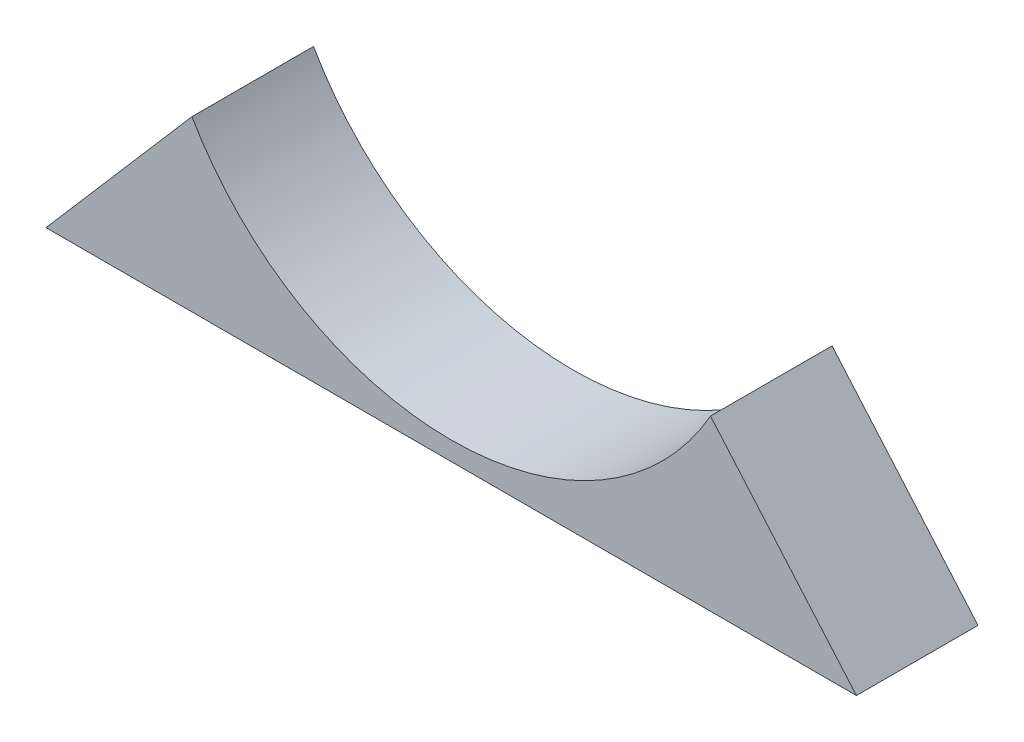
from build123d import *

# Parameters (mm, degrees)
EXTRUDE1_DEPTH = 27.94


with BuildPart() as part:
    # Sketch1 → Extrude1 (new body)
    with BuildSketch(Plane.XY):
        with BuildLine():
            Line((-93.12947242, -72.935985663), (93.12947242, -72.935985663))
            Line((93.12947242, -72.935985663), (59.589807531, -34.07126839))
            ThreePointArc((59.589807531, -34.07126839), (0, -68.642526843), (-59.589807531, -34.07126839))
            Line((-59.589807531, -34.07126839), (-93.12947242, -72.935985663))
        make_face()
    extrude(amount=EXTRUDE1_DEPTH)


solid = part.part
